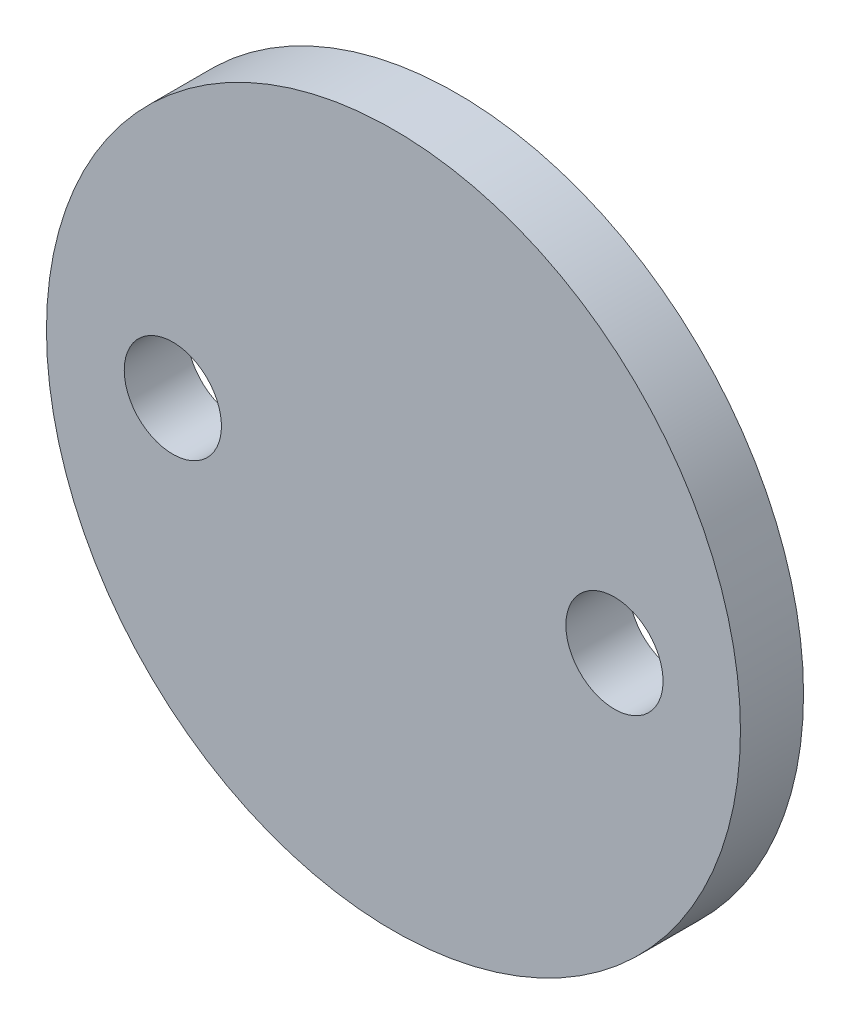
from build123d import *

# Parameters (mm, degrees)
SKETCH1_R          = 17.4625
EXTRUDE1_DEPTH     = 3.175
SKETCH3_R          = 2.44475
CUT_EXTRUDE1_DEPTH = 25.898964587


with BuildPart() as part:
    # Sketch1 → Extrude1 (new body)
    with BuildSketch(Plane.XY):
        Circle(SKETCH1_R)
    extrude(amount=EXTRUDE1_DEPTH)

    # Sketch3 → Cut-Extrude1 (cut, through all)
    with BuildSketch(Plane(origin=(0, 0, 0), x_dir=(-1, 0, 0), z_dir=(0, 0, -1))):
        with Locations((-11.121757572, 0.20507569)):
            Circle(SKETCH3_R)
        with Locations((11.103242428, 0.20507569)):
            Circle(SKETCH3_R)
    extrude(amount=-CUT_EXTRUDE1_DEPTH, mode=Mode.SUBTRACT)


solid = part.part
